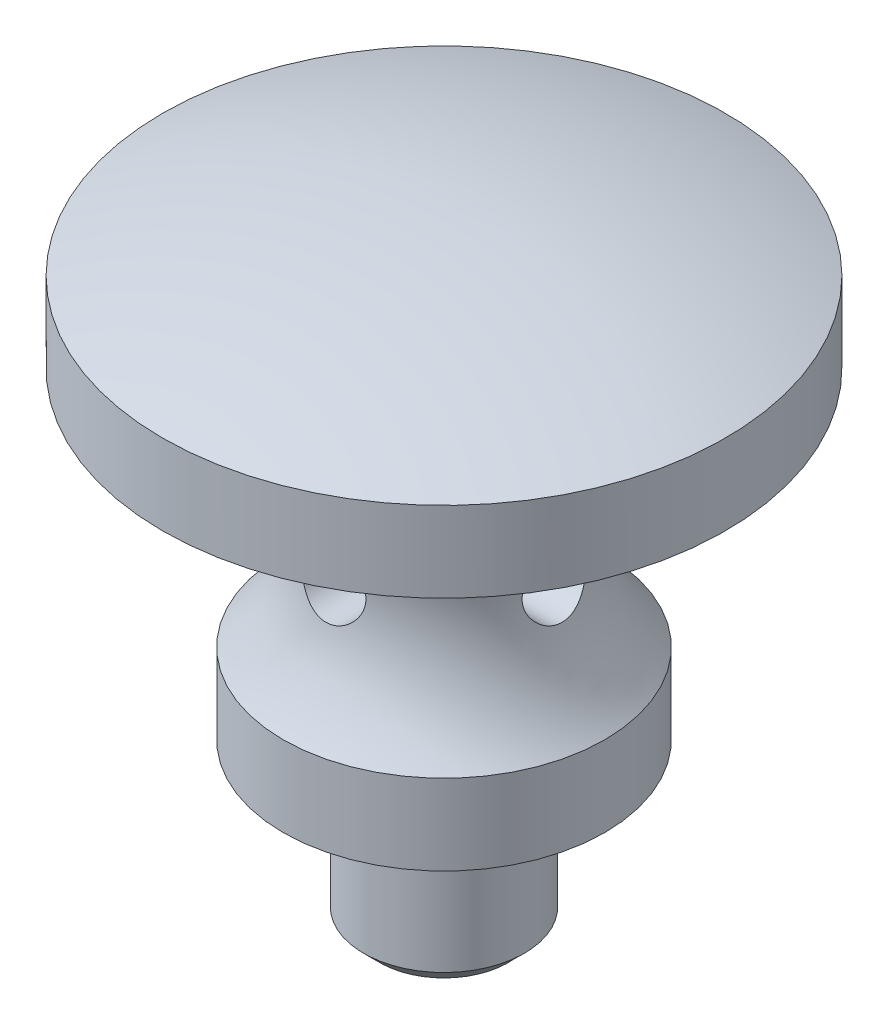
from build123d import *

# Parameters (mm, degrees)
CHAMFER1_SIZE                             = 1
FILLET1_R                                 = 0.5
CUT_EXTRUDE1_REACH                        = 47.485
CUT_EXTRUDE1_END_MAJOR_RADIUS             = 17.141428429
CUT_EXTRUDE1_END_MINOR_RADIUS             = 10
SKETCH3_R                                 = 2
CUT_EXTRUDE1_DIRECTION_2_REACH            = 47.485
CUT_EXTRUDE1_DIRECTION_2_END_MAJOR_RADIUS = 17.141428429
CUT_EXTRUDE1_DIRECTION_2_END_MINOR_RADIUS = 10
CUT_EXTRUDE2_REACH                        = 47.485
SKETCH4_R                                 = 2
CUT_EXTRUDE2_DIRECTION_2_REACH            = 47.485
SKETCH5_R                                 = 2
CUT_EXTRUDE3_DEPTH                        = 25


with BuildPart() as part:
    # Sketch1 → Revolve1 (revolve)
    with BuildSketch(Plane.XY, mode=Mode.PRIVATE) as revolve1_sk:
        with BuildLine():
            Line((0, 0), (-5, 0))
            Line((-5, 0), (-5, 10))
            Line((-5, 10), (-10, 10))
            Line((-10, 10), (-10, 15))
            ThreePointArc((-10, 15), (-7.170255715, 22.758758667), (-11.141428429, 30))
            Line((-11.141428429, 30), (-17.5, 30))
            Line((-17.5, 30), (-17.5, 35))
            ThreePointArc((-17.5, 35), (-8.891730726, 37.365534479), (0, 38.162515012))
            Line((0, 38.162515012), (0, 0))
        make_face()
    revolve(revolve1_sk.sketch.rotate(Axis((0, 75.05066604, 0), (0, -1, 0)), 270), axis=Axis((0, 75.05066604, 0), (0, -1, 0)))

    # Chamfer1
    chamfer1_edges = [part.edges().sort_by_distance(p)[0] for p in [
        (0, 0, -5),
    ]]
    chamfer(chamfer1_edges, length=CHAMFER1_SIZE)

    # Sketch2 → Cut-Revolve1 (revolve, cut)
    with BuildSketch(Plane.XY, mode=Mode.PRIVATE) as cut_revolve1_sk:
        Polygon((-5, 10), (-4.5, 10), (-4.5, 9), (-5, 8.5), align=None)
    revolve(cut_revolve1_sk.sketch.rotate(Axis((0, -5.304987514, 0), (0, 1, 0)), 270), axis=Axis((0, -5.304987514, 0), (0, 1, 0)), mode=Mode.SUBTRACT)

    # Fillet1
    fillet1_edges = [part.edges().sort_by_distance(p)[0] for p in [
        (0, 10, 4.5),
        (0, 9, 4.5),
    ]]
    fillet(fillet1_edges, radius=FILLET1_R)

    # Cut-Extrude1: up to this torus (the profile starts outside it)
    cut_extrude1_end = Plane(origin=(0, 22, 0), z_dir=(0, 1, 0)) * Torus(CUT_EXTRUDE1_END_MAJOR_RADIUS, CUT_EXTRUDE1_END_MINOR_RADIUS, mode=Mode.PRIVATE)
    # Sketch3 → Cut-Extrude1 (cut, up to the surface)
    with BuildSketch(Plane.XY, mode=Mode.PRIVATE) as cut_extrude1_sk1:
        with Locations(Location((0, 22, 0), (0, 0, 230.801522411))):
            Circle(SKETCH3_R)
    cut_extrude1_tool1 = extrude(cut_extrude1_sk1.sketch, amount=-CUT_EXTRUDE1_REACH, mode=Mode.PRIVATE) - cut_extrude1_end
    add(cut_extrude1_tool1.solids().sort_by_distance((0, 22, 0))[0], mode=Mode.SUBTRACT)

    # Cut-Extrude1 direction 2: up to this torus (the profile starts outside it)
    cut_extrude1_direction_2_end = Plane(origin=(0, 22, 0), z_dir=(0, 1, 0)) * Torus(CUT_EXTRUDE1_DIRECTION_2_END_MAJOR_RADIUS, CUT_EXTRUDE1_DIRECTION_2_END_MINOR_RADIUS, mode=Mode.PRIVATE)
    # Sketch3 → Cut-Extrude1 direction 2 (cut, up to the surface)
    with BuildSketch(Plane.XY, mode=Mode.PRIVATE) as cut_extrude1_direction_2_sk1:
        with Locations(Location((0, 22, 0), (0, 0, 230.801522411))):
            Circle(SKETCH3_R)
    cut_extrude1_direction_2_tool1 = extrude(cut_extrude1_direction_2_sk1.sketch, amount=CUT_EXTRUDE1_DIRECTION_2_REACH, mode=Mode.PRIVATE) - cut_extrude1_direction_2_end
    add(cut_extrude1_direction_2_tool1.solids().sort_by_distance((0, 22, 0))[0], mode=Mode.SUBTRACT)

    # Sketch4 → Cut-Extrude2 (cut, up to next)
    with BuildSketch(Plane(origin=(0, 0, 0), x_dir=(0, 0, -1), z_dir=(1, 0, 0)), mode=Mode.PRIVATE) as cut_extrude2_sk1:
        with Locations(Location((0, 22, 0), (0, 0, 270))):
            Circle(SKETCH4_R)
    cut_extrude2_tool1 = extrude(cut_extrude2_sk1.sketch, amount=-CUT_EXTRUDE2_REACH, mode=Mode.PRIVATE) & part.part
    add(cut_extrude2_tool1.solids().sort_by_distance((0, 22, 0))[0], mode=Mode.SUBTRACT)

    # Sketch4 → Cut-Extrude2 direction 2 (cut, up to next)
    with BuildSketch(Plane(origin=(0, 0, 0), x_dir=(0, 0, -1), z_dir=(1, 0, 0)), mode=Mode.PRIVATE) as cut_extrude2_direction_2_sk1:
        with Locations(Location((0, 22, 0), (0, 0, 270))):
            Circle(SKETCH4_R)
    cut_extrude2_direction_2_tool1 = extrude(cut_extrude2_direction_2_sk1.sketch, amount=CUT_EXTRUDE2_DIRECTION_2_REACH, mode=Mode.PRIVATE) & part.part
    add(cut_extrude2_direction_2_tool1.solids().sort_by_distance((0, 22, 0))[0], mode=Mode.SUBTRACT)

    # Sketch5 → Cut-Extrude3 (cut)
    with BuildSketch(Plane.XZ):
        with Locations(Location((0, 0, 0), (0, 0, 270))):
            Circle(SKETCH5_R)
    extrude(amount=-CUT_EXTRUDE3_DEPTH, mode=Mode.SUBTRACT)

    # Cut-Extrude5 cone 1 section (on through the dimple's axis) → Cut-Extrude5 (revolve, cut)
    with BuildSketch(Plane(origin=(0, 25, 0), x_dir=(0, 0, -1), z_dir=(1, 0, 0))):
        Polygon((0, 0), (2, 0), (0, 1.154700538), align=None)
    revolve(axis=Axis((0, 25, 0), (0, 1, 0)), mode=Mode.SUBTRACT)


solid = part.part
